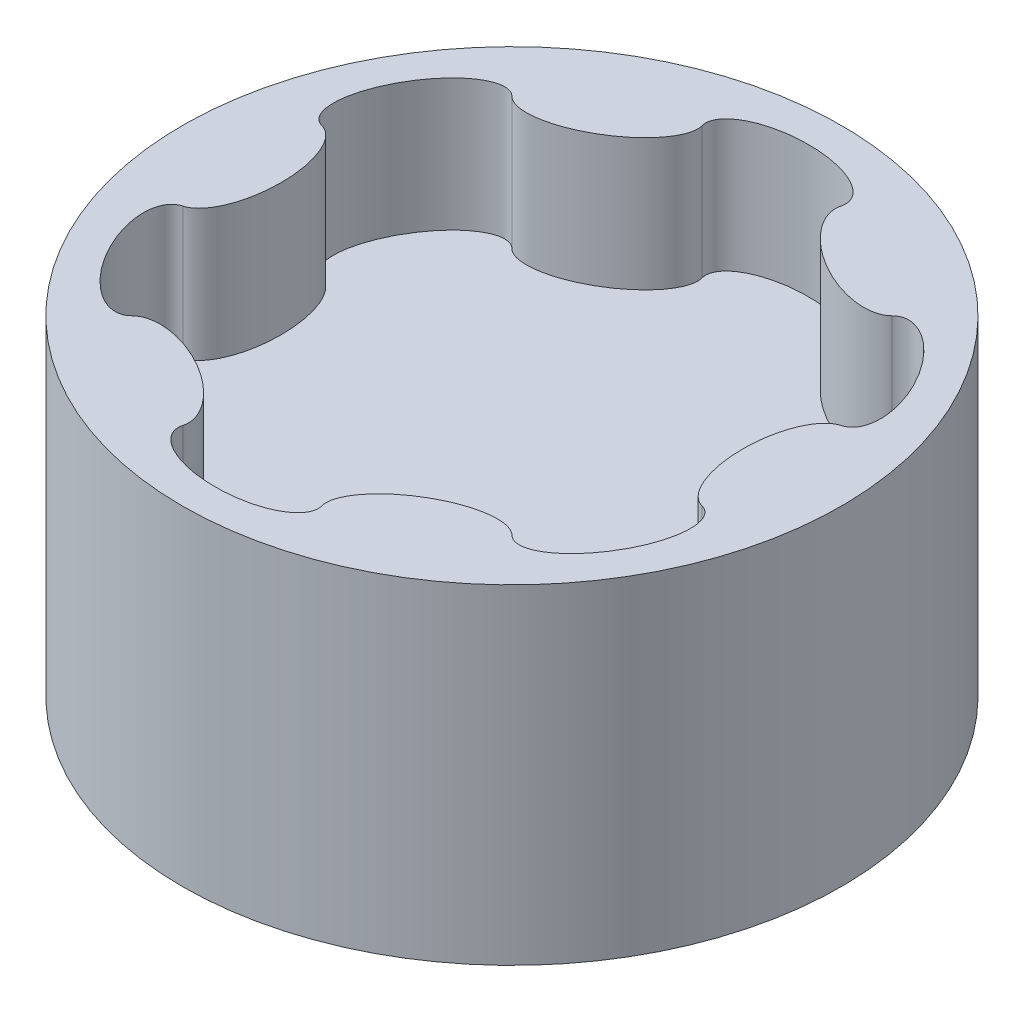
ISO-10303-21;
HEADER;
FILE_DESCRIPTION(('STEP AP214'),'2;1');
FILE_NAME('part.step','',(''),(''),'','','');
FILE_SCHEMA(('AUTOMOTIVE_DESIGN { 1 0 10303 214 1 1 1 1 }'));
ENDSEC;
DATA;
#1=APPLICATION_CONTEXT('core data for automotive mechanical design processes');
#2=APPLICATION_PROTOCOL_DEFINITION('international standard','automotive_design',2000,#1);
#3=PRODUCT_CONTEXT('',#1,'mechanical');
#4=PRODUCT('Part','Part','',(#3));
#5=PRODUCT_RELATED_PRODUCT_CATEGORY('part','',(#4));
#6=PRODUCT_DEFINITION_FORMATION('','',#4);
#7=PRODUCT_DEFINITION_CONTEXT('part definition',#1,'design');
#8=PRODUCT_DEFINITION('design','',#6,#7);
#9=PRODUCT_DEFINITION_SHAPE('','',#8);
#10=(LENGTH_UNIT() NAMED_UNIT(*) SI_UNIT(.MILLI.,.METRE.));
#11=(NAMED_UNIT(*) PLANE_ANGLE_UNIT() SI_UNIT($,.RADIAN.));
#12=(NAMED_UNIT(*) SI_UNIT($,.STERADIAN.) SOLID_ANGLE_UNIT());
#13=UNCERTAINTY_MEASURE_WITH_UNIT(LENGTH_MEASURE(1.E-05),#10,'distance_accuracy_value','');
#14=(GEOMETRIC_REPRESENTATION_CONTEXT(3) GLOBAL_UNCERTAINTY_ASSIGNED_CONTEXT((#13)) GLOBAL_UNIT_ASSIGNED_CONTEXT((#10,
#11,#12)) REPRESENTATION_CONTEXT('',''));
#15=CARTESIAN_POINT('',(0.,0.,0.));
#16=DIRECTION('',(0.,0.,1.));
#17=DIRECTION('',(1.,0.,0.));
#18=AXIS2_PLACEMENT_3D('',#15,#16,#17);
#19=CARTESIAN_POINT('',(0.,2.5,0.));
#20=DIRECTION('',(0.,1.,0.));
#21=DIRECTION('',(0.,0.,1.));
#22=AXIS2_PLACEMENT_3D('',#19,#20,#21);
#23=PLANE('',#22);
#24=CARTESIAN_POINT('',(0.,2.5,0.));
#25=DIRECTION('',(0.,1.,0.));
#26=DIRECTION('',(0.,0.,1.));
#27=AXIS2_PLACEMENT_3D('',#24,#25,#26);
#28=CIRCLE('',#27,5.);
#29=CARTESIAN_POINT('',(0.,2.5,5.));
#30=VERTEX_POINT('',#29);
#31=EDGE_CURVE('E11',#30,#30,#28,.T.);
#32=ORIENTED_EDGE('',*,*,#31,.T.);
#33=EDGE_LOOP('',(#32));
#34=FACE_BOUND('',#33,.T.);
#35=CARTESIAN_POINT('',(-3.46410161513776,2.5,-1.99999999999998));
#36=DIRECTION('',(0.,1.,0.));
#37=DIRECTION('',(0.499999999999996,0.,-0.866025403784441));
#38=AXIS2_PLACEMENT_3D('',#35,#36,#37);
#39=ELLIPSE('',#38,1.06339039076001,0.5);
#40=CARTESIAN_POINT('',(-2.88245005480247,2.5,-2.88245005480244));
#41=VERTEX_POINT('',#40);
#42=CARTESIAN_POINT('',(-3.93750000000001,2.5,-1.05504994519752));
#43=VERTEX_POINT('',#42);
#44=EDGE_CURVE('E1762',#41,#43,#39,.T.);
#45=ORIENTED_EDGE('',*,*,#44,.F.);
#46=CARTESIAN_POINT('',(-2.00000000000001,2.5,-3.46410161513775));
#47=DIRECTION('',(0.,1.,0.));
#48=DIRECTION('',(0.866025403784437,0.,-0.500000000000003));
#49=AXIS2_PLACEMENT_3D('',#46,#47,#48);
#50=ELLIPSE('',#49,1.06339039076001,0.5);
#51=CARTESIAN_POINT('',(-1.05504994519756,2.5,-3.9375));
#52=VERTEX_POINT('',#51);
#53=EDGE_CURVE('E1674',#41,#52,#50,.T.);
#54=ORIENTED_EDGE('',*,*,#53,.T.);
#55=CARTESIAN_POINT('',(0.,2.5,-4.));
#56=DIRECTION('',(0.,1.,0.));
#57=DIRECTION('',(-1.,0.,0.));
#58=AXIS2_PLACEMENT_3D('',#55,#56,#57);
#59=ELLIPSE('',#58,1.06339039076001,0.5);
#60=CARTESIAN_POINT('',(1.05504994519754,2.5,-3.9375));
#61=VERTEX_POINT('',#60);
#62=EDGE_CURVE('E1793',#61,#52,#59,.T.);
#63=ORIENTED_EDGE('',*,*,#62,.F.);
#64=CARTESIAN_POINT('',(1.99999999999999,2.5,-3.46410161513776));
#65=DIRECTION('',(0.,1.,0.));
#66=DIRECTION('',(0.86602540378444,0.,0.499999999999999));
#67=AXIS2_PLACEMENT_3D('',#64,#65,#66);
#68=ELLIPSE('',#67,1.06339039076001,0.499999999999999);
#69=CARTESIAN_POINT('',(2.88245005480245,2.5,-2.88245005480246));
#70=VERTEX_POINT('',#69);
#71=EDGE_CURVE('E1790',#61,#70,#68,.T.);
#72=ORIENTED_EDGE('',*,*,#71,.T.);
#73=CARTESIAN_POINT('',(3.46410161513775,2.5,-2.));
#74=DIRECTION('',(0.,1.,0.));
#75=DIRECTION('',(0.500000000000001,0.,0.866025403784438));
#76=AXIS2_PLACEMENT_3D('',#73,#74,#75);
#77=ELLIPSE('',#76,1.06339039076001,0.500000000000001);
#78=CARTESIAN_POINT('',(3.9375,2.5,-1.05504994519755));
#79=VERTEX_POINT('',#78);
#80=EDGE_CURVE('E1787',#79,#70,#77,.T.);
#81=ORIENTED_EDGE('',*,*,#80,.F.);
#82=CARTESIAN_POINT('',(4.,2.5,0.));
#83=DIRECTION('',(0.,1.,0.));
#84=DIRECTION('',(0.,0.,1.));
#85=AXIS2_PLACEMENT_3D('',#82,#83,#84);
#86=ELLIPSE('',#85,1.06339039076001,0.5);
#87=CARTESIAN_POINT('',(3.9375,2.5,1.05504994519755));
#88=VERTEX_POINT('',#87);
#89=EDGE_CURVE('E1784',#79,#88,#86,.T.);
#90=ORIENTED_EDGE('',*,*,#89,.T.);
#91=CARTESIAN_POINT('',(3.46410161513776,2.5,1.99999999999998));
#92=DIRECTION('',(0.,1.,0.));
#93=DIRECTION('',(0.499999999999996,0.,-0.866025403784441));
#94=AXIS2_PLACEMENT_3D('',#91,#92,#93);
#95=ELLIPSE('',#94,1.06339039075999,0.5);
#96=CARTESIAN_POINT('',(2.88245005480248,2.5,2.88245005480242));
#97=VERTEX_POINT('',#96);
#98=EDGE_CURVE('E1781',#97,#88,#95,.T.);
#99=ORIENTED_EDGE('',*,*,#98,.F.);
#100=CARTESIAN_POINT('',(2.00000000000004,2.5,3.46410161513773));
#101=DIRECTION('',(0.,1.,0.));
#102=DIRECTION('',(-0.866025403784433,0.,0.50000000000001));
#103=AXIS2_PLACEMENT_3D('',#100,#101,#102);
#104=ELLIPSE('',#103,1.06339039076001,0.500000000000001);
#105=CARTESIAN_POINT('',(1.05504994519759,2.5,3.93749999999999));
#106=VERTEX_POINT('',#105);
#107=EDGE_CURVE('E1778',#97,#106,#104,.T.);
#108=ORIENTED_EDGE('',*,*,#107,.T.);
#109=CARTESIAN_POINT('',(0.,2.5,4.));
#110=DIRECTION('',(0.,1.,0.));
#111=DIRECTION('',(-1.,0.,0.));
#112=AXIS2_PLACEMENT_3D('',#109,#110,#111);
#113=ELLIPSE('',#112,1.06339039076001,0.5);
#114=CARTESIAN_POINT('',(-1.05504994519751,2.5,3.93750000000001));
#115=VERTEX_POINT('',#114);
#116=EDGE_CURVE('E1775',#115,#106,#113,.T.);
#117=ORIENTED_EDGE('',*,*,#116,.F.);
#118=CARTESIAN_POINT('',(-1.99999999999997,2.5,3.46410161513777));
#119=DIRECTION('',(0.,1.,0.));
#120=DIRECTION('',(-0.866025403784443,0.,-0.499999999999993));
#121=AXIS2_PLACEMENT_3D('',#118,#119,#120);
#122=ELLIPSE('',#121,1.06339039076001,0.499999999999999);
#123=CARTESIAN_POINT('',(-2.88245005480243,2.5,2.88245005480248));
#124=VERTEX_POINT('',#123);
#125=EDGE_CURVE('E1770',#115,#124,#122,.T.);
#126=ORIENTED_EDGE('',*,*,#125,.T.);
#127=CARTESIAN_POINT('',(-3.46410161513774,2.5,2.00000000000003));
#128=DIRECTION('',(0.,1.,0.));
#129=DIRECTION('',(-0.500000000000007,0.,-0.866025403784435));
#130=AXIS2_PLACEMENT_3D('',#127,#128,#129);
#131=ELLIPSE('',#130,1.06339039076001,0.500000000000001);
#132=CARTESIAN_POINT('',(-3.93749999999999,2.5,1.05504994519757));
#133=VERTEX_POINT('',#132);
#134=EDGE_CURVE('E1768',#133,#124,#131,.T.);
#135=ORIENTED_EDGE('',*,*,#134,.F.);
#136=CARTESIAN_POINT('',(-4.,2.5,0.));
#137=DIRECTION('',(0.,1.,0.));
#138=DIRECTION('',(0.,0.,-1.));
#139=AXIS2_PLACEMENT_3D('',#136,#137,#138);
#140=ELLIPSE('',#139,1.06339039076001,0.5);
#141=EDGE_CURVE('E1751',#133,#43,#140,.T.);
#142=ORIENTED_EDGE('',*,*,#141,.T.);
#143=EDGE_LOOP('',(#45,#54,#63,#72,#81,#90,#99,#108,#117,#126,#135,#142));
#144=FACE_BOUND('',#143,.T.);
#145=ADVANCED_FACE('F1659',(#34,#144),#23,.T.);
#146=CARTESIAN_POINT('',(0.,2.5,0.));
#147=DIRECTION('',(0.,-1.,0.));
#148=DIRECTION('',(0.,0.,-1.));
#149=AXIS2_PLACEMENT_3D('',#146,#147,#148);
#150=CYLINDRICAL_SURFACE('',#149,5.);
#151=ORIENTED_EDGE('',*,*,#31,.F.);
#152=EDGE_LOOP('',(#151));
#153=FACE_BOUND('',#152,.T.);
#154=CARTESIAN_POINT('',(0.,-2.5,0.));
#155=DIRECTION('',(0.,1.,0.));
#156=DIRECTION('',(0.,0.,1.));
#157=AXIS2_PLACEMENT_3D('',#154,#155,#156);
#158=CIRCLE('',#157,5.);
#159=CARTESIAN_POINT('',(0.,-2.5,5.));
#160=VERTEX_POINT('',#159);
#161=EDGE_CURVE('E1667',#160,#160,#158,.T.);
#162=ORIENTED_EDGE('',*,*,#161,.T.);
#163=EDGE_LOOP('',(#162));
#164=FACE_BOUND('',#163,.T.);
#165=ADVANCED_FACE('F1661',(#153,#164),#150,.T.);
#166=CARTESIAN_POINT('',(0.,-2.5,0.));
#167=DIRECTION('',(0.,1.,0.));
#168=DIRECTION('',(0.,0.,1.));
#169=AXIS2_PLACEMENT_3D('',#166,#167,#168);
#170=PLANE('',#169);
#171=ORIENTED_EDGE('',*,*,#161,.F.);
#172=EDGE_LOOP('',(#171));
#173=FACE_BOUND('',#172,.T.);
#174=ADVANCED_FACE('F1807',(#173),#170,.F.);
#175=CARTESIAN_POINT('',(-2.00000000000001,0.5,-3.46410161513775));
#176=DIRECTION('',(0.,1.,0.));
#177=DIRECTION('',(0.866025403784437,0.,-0.500000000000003));
#178=AXIS2_PLACEMENT_3D('',#175,#176,#177);
#179=ELLIPSE('',#178,1.06339039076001,0.5);
#180=DIRECTION('',(0.,1.,0.));
#181=VECTOR('',#180,1.);
#182=SURFACE_OF_LINEAR_EXTRUSION('',#179,#181);
#183=ORIENTED_EDGE('',*,*,#53,.F.);
#184=DIRECTION('',(0.,1.,0.));
#185=VECTOR('',#184,1.);
#186=CARTESIAN_POINT('',(-2.88245005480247,0.5,-2.88245005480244));
#187=LINE('',#186,#185);
#188=CARTESIAN_POINT('',(-2.88245005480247,0.5,-2.88245005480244));
#189=VERTEX_POINT('',#188);
#190=EDGE_CURVE('E1759',#189,#41,#187,.T.);
#191=ORIENTED_EDGE('',*,*,#190,.F.);
#192=CARTESIAN_POINT('',(-1.05504994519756,0.5,-3.9375));
#193=VERTEX_POINT('',#192);
#194=EDGE_CURVE('E1679',#189,#193,#179,.T.);
#195=ORIENTED_EDGE('',*,*,#194,.T.);
#196=DIRECTION('',(0.,1.,0.));
#197=VECTOR('',#196,1.);
#198=CARTESIAN_POINT('',(-1.05504994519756,0.5,-3.9375));
#199=LINE('',#198,#197);
#200=EDGE_CURVE('E1821',#193,#52,#199,.T.);
#201=ORIENTED_EDGE('',*,*,#200,.T.);
#202=EDGE_LOOP('',(#183,#191,#195,#201));
#203=FACE_BOUND('',#202,.T.);
#204=ADVANCED_FACE('F1802',(#203),#182,.T.);
#205=CARTESIAN_POINT('',(0.,0.5,-4.));
#206=DIRECTION('',(0.,1.,0.));
#207=DIRECTION('',(-1.,0.,0.));
#208=AXIS2_PLACEMENT_3D('',#205,#206,#207);
#209=ELLIPSE('',#208,1.06339039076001,0.5);
#210=DIRECTION('',(0.,1.,0.));
#211=VECTOR('',#210,1.);
#212=SURFACE_OF_LINEAR_EXTRUSION('',#209,#211);
#213=ORIENTED_EDGE('',*,*,#62,.T.);
#214=ORIENTED_EDGE('',*,*,#200,.F.);
#215=CARTESIAN_POINT('',(1.05504994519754,0.5,-3.9375));
#216=VERTEX_POINT('',#215);
#217=EDGE_CURVE('E1825',#216,#193,#209,.T.);
#218=ORIENTED_EDGE('',*,*,#217,.F.);
#219=DIRECTION('',(0.,1.,0.));
#220=VECTOR('',#219,1.);
#221=CARTESIAN_POINT('',(1.05504994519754,0.5,-3.9375));
#222=LINE('',#221,#220);
#223=EDGE_CURVE('E1822',#216,#61,#222,.T.);
#224=ORIENTED_EDGE('',*,*,#223,.T.);
#225=EDGE_LOOP('',(#213,#214,#218,#224));
#226=FACE_BOUND('',#225,.T.);
#227=ADVANCED_FACE('F1806',(#226),#212,.F.);
#228=CARTESIAN_POINT('',(1.99999999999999,0.5,-3.46410161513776));
#229=DIRECTION('',(0.,1.,0.));
#230=DIRECTION('',(0.86602540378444,0.,0.499999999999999));
#231=AXIS2_PLACEMENT_3D('',#228,#229,#230);
#232=ELLIPSE('',#231,1.06339039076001,0.499999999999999);
#233=DIRECTION('',(0.,1.,0.));
#234=VECTOR('',#233,1.);
#235=SURFACE_OF_LINEAR_EXTRUSION('',#232,#234);
#236=ORIENTED_EDGE('',*,*,#71,.F.);
#237=ORIENTED_EDGE('',*,*,#223,.F.);
#238=CARTESIAN_POINT('',(2.88245005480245,0.5,-2.88245005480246));
#239=VERTEX_POINT('',#238);
#240=EDGE_CURVE('E1846',#216,#239,#232,.T.);
#241=ORIENTED_EDGE('',*,*,#240,.T.);
#242=DIRECTION('',(0.,1.,0.));
#243=VECTOR('',#242,1.);
#244=CARTESIAN_POINT('',(2.88245005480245,0.5,-2.88245005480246));
#245=LINE('',#244,#243);
#246=EDGE_CURVE('E1840',#239,#70,#245,.T.);
#247=ORIENTED_EDGE('',*,*,#246,.T.);
#248=EDGE_LOOP('',(#236,#237,#241,#247));
#249=FACE_BOUND('',#248,.T.);
#250=ADVANCED_FACE('F1853',(#249),#235,.T.);
#251=CARTESIAN_POINT('',(3.46410161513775,0.5,-2.));
#252=DIRECTION('',(0.,1.,0.));
#253=DIRECTION('',(0.500000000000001,0.,0.866025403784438));
#254=AXIS2_PLACEMENT_3D('',#251,#252,#253);
#255=ELLIPSE('',#254,1.06339039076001,0.500000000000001);
#256=DIRECTION('',(0.,1.,0.));
#257=VECTOR('',#256,1.);
#258=SURFACE_OF_LINEAR_EXTRUSION('',#255,#257);
#259=ORIENTED_EDGE('',*,*,#80,.T.);
#260=ORIENTED_EDGE('',*,*,#246,.F.);
#261=CARTESIAN_POINT('',(3.9375,0.5,-1.05504994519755));
#262=VERTEX_POINT('',#261);
#263=EDGE_CURVE('E1866',#262,#239,#255,.T.);
#264=ORIENTED_EDGE('',*,*,#263,.F.);
#265=DIRECTION('',(0.,1.,0.));
#266=VECTOR('',#265,1.);
#267=CARTESIAN_POINT('',(3.9375,0.5,-1.05504994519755));
#268=LINE('',#267,#266);
#269=EDGE_CURVE('E1838',#262,#79,#268,.T.);
#270=ORIENTED_EDGE('',*,*,#269,.T.);
#271=EDGE_LOOP('',(#259,#260,#264,#270));
#272=FACE_BOUND('',#271,.T.);
#273=ADVANCED_FACE('F1858',(#272),#258,.F.);
#274=CARTESIAN_POINT('',(4.,0.5,0.));
#275=DIRECTION('',(0.,1.,0.));
#276=DIRECTION('',(0.,0.,1.));
#277=AXIS2_PLACEMENT_3D('',#274,#275,#276);
#278=ELLIPSE('',#277,1.06339039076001,0.5);
#279=DIRECTION('',(0.,1.,0.));
#280=VECTOR('',#279,1.);
#281=SURFACE_OF_LINEAR_EXTRUSION('',#278,#280);
#282=ORIENTED_EDGE('',*,*,#89,.F.);
#283=ORIENTED_EDGE('',*,*,#269,.F.);
#284=CARTESIAN_POINT('',(3.9375,0.5,1.05504994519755));
#285=VERTEX_POINT('',#284);
#286=EDGE_CURVE('E1869',#262,#285,#278,.T.);
#287=ORIENTED_EDGE('',*,*,#286,.T.);
#288=DIRECTION('',(0.,1.,0.));
#289=VECTOR('',#288,1.);
#290=CARTESIAN_POINT('',(3.9375,0.5,1.05504994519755));
#291=LINE('',#290,#289);
#292=EDGE_CURVE('E1836',#285,#88,#291,.T.);
#293=ORIENTED_EDGE('',*,*,#292,.T.);
#294=EDGE_LOOP('',(#282,#283,#287,#293));
#295=FACE_BOUND('',#294,.T.);
#296=ADVANCED_FACE('F1862',(#295),#281,.T.);
#297=CARTESIAN_POINT('',(3.46410161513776,0.5,1.99999999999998));
#298=DIRECTION('',(0.,1.,0.));
#299=DIRECTION('',(0.499999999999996,0.,-0.866025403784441));
#300=AXIS2_PLACEMENT_3D('',#297,#298,#299);
#301=ELLIPSE('',#300,1.06339039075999,0.5);
#302=DIRECTION('',(0.,1.,0.));
#303=VECTOR('',#302,1.);
#304=SURFACE_OF_LINEAR_EXTRUSION('',#301,#303);
#305=ORIENTED_EDGE('',*,*,#98,.T.);
#306=ORIENTED_EDGE('',*,*,#292,.F.);
#307=CARTESIAN_POINT('',(2.88245005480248,0.5,2.88245005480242));
#308=VERTEX_POINT('',#307);
#309=EDGE_CURVE('E1872',#308,#285,#301,.T.);
#310=ORIENTED_EDGE('',*,*,#309,.F.);
#311=DIRECTION('',(0.,1.,0.));
#312=VECTOR('',#311,1.);
#313=CARTESIAN_POINT('',(2.88245005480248,0.5,2.88245005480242));
#314=LINE('',#313,#312);
#315=EDGE_CURVE('E1834',#308,#97,#314,.T.);
#316=ORIENTED_EDGE('',*,*,#315,.T.);
#317=EDGE_LOOP('',(#305,#306,#310,#316));
#318=FACE_BOUND('',#317,.T.);
#319=ADVANCED_FACE('F1879',(#318),#304,.F.);
#320=CARTESIAN_POINT('',(2.00000000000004,0.5,3.46410161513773));
#321=DIRECTION('',(0.,1.,0.));
#322=DIRECTION('',(-0.866025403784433,0.,0.50000000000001));
#323=AXIS2_PLACEMENT_3D('',#320,#321,#322);
#324=ELLIPSE('',#323,1.06339039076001,0.500000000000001);
#325=DIRECTION('',(0.,1.,0.));
#326=VECTOR('',#325,1.);
#327=SURFACE_OF_LINEAR_EXTRUSION('',#324,#326);
#328=ORIENTED_EDGE('',*,*,#107,.F.);
#329=ORIENTED_EDGE('',*,*,#315,.F.);
#330=CARTESIAN_POINT('',(1.05504994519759,0.5,3.93749999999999));
#331=VERTEX_POINT('',#330);
#332=EDGE_CURVE('E1876',#308,#331,#324,.T.);
#333=ORIENTED_EDGE('',*,*,#332,.T.);
#334=DIRECTION('',(0.,1.,0.));
#335=VECTOR('',#334,1.);
#336=CARTESIAN_POINT('',(1.05504994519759,0.5,3.93749999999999));
#337=LINE('',#336,#335);
#338=EDGE_CURVE('E1832',#331,#106,#337,.T.);
#339=ORIENTED_EDGE('',*,*,#338,.T.);
#340=EDGE_LOOP('',(#328,#329,#333,#339));
#341=FACE_BOUND('',#340,.T.);
#342=ADVANCED_FACE('F1882',(#341),#327,.T.);
#343=CARTESIAN_POINT('',(0.,0.5,4.));
#344=DIRECTION('',(0.,1.,0.));
#345=DIRECTION('',(-1.,0.,0.));
#346=AXIS2_PLACEMENT_3D('',#343,#344,#345);
#347=ELLIPSE('',#346,1.06339039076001,0.5);
#348=DIRECTION('',(0.,1.,0.));
#349=VECTOR('',#348,1.);
#350=SURFACE_OF_LINEAR_EXTRUSION('',#347,#349);
#351=ORIENTED_EDGE('',*,*,#116,.T.);
#352=ORIENTED_EDGE('',*,*,#338,.F.);
#353=CARTESIAN_POINT('',(-1.05504994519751,0.5,3.93750000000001));
#354=VERTEX_POINT('',#353);
#355=EDGE_CURVE('E1894',#354,#331,#347,.T.);
#356=ORIENTED_EDGE('',*,*,#355,.F.);
#357=DIRECTION('',(0.,1.,0.));
#358=VECTOR('',#357,1.);
#359=CARTESIAN_POINT('',(-1.05504994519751,0.5,3.93750000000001));
#360=LINE('',#359,#358);
#361=EDGE_CURVE('E1830',#354,#115,#360,.T.);
#362=ORIENTED_EDGE('',*,*,#361,.T.);
#363=EDGE_LOOP('',(#351,#352,#356,#362));
#364=FACE_BOUND('',#363,.T.);
#365=ADVANCED_FACE('F1886',(#364),#350,.F.);
#366=CARTESIAN_POINT('',(-1.99999999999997,0.5,3.46410161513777));
#367=DIRECTION('',(0.,1.,0.));
#368=DIRECTION('',(-0.866025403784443,0.,-0.499999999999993));
#369=AXIS2_PLACEMENT_3D('',#366,#367,#368);
#370=ELLIPSE('',#369,1.06339039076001,0.499999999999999);
#371=DIRECTION('',(0.,1.,0.));
#372=VECTOR('',#371,1.);
#373=SURFACE_OF_LINEAR_EXTRUSION('',#370,#372);
#374=ORIENTED_EDGE('',*,*,#125,.F.);
#375=ORIENTED_EDGE('',*,*,#361,.F.);
#376=CARTESIAN_POINT('',(-2.88245005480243,0.5,2.88245005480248));
#377=VERTEX_POINT('',#376);
#378=EDGE_CURVE('E1897',#354,#377,#370,.T.);
#379=ORIENTED_EDGE('',*,*,#378,.T.);
#380=DIRECTION('',(0.,1.,0.));
#381=VECTOR('',#380,1.);
#382=CARTESIAN_POINT('',(-2.88245005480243,0.5,2.88245005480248));
#383=LINE('',#382,#381);
#384=EDGE_CURVE('E1828',#377,#124,#383,.T.);
#385=ORIENTED_EDGE('',*,*,#384,.T.);
#386=EDGE_LOOP('',(#374,#375,#379,#385));
#387=FACE_BOUND('',#386,.T.);
#388=ADVANCED_FACE('F1890',(#387),#373,.T.);
#389=CARTESIAN_POINT('',(-3.46410161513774,0.5,2.00000000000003));
#390=DIRECTION('',(0.,1.,0.));
#391=DIRECTION('',(-0.500000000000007,0.,-0.866025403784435));
#392=AXIS2_PLACEMENT_3D('',#389,#390,#391);
#393=ELLIPSE('',#392,1.06339039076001,0.500000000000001);
#394=DIRECTION('',(0.,1.,0.));
#395=VECTOR('',#394,1.);
#396=SURFACE_OF_LINEAR_EXTRUSION('',#393,#395);
#397=ORIENTED_EDGE('',*,*,#134,.T.);
#398=ORIENTED_EDGE('',*,*,#384,.F.);
#399=CARTESIAN_POINT('',(-3.93749999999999,0.5,1.05504994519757));
#400=VERTEX_POINT('',#399);
#401=EDGE_CURVE('E1900',#400,#377,#393,.T.);
#402=ORIENTED_EDGE('',*,*,#401,.F.);
#403=DIRECTION('',(0.,1.,0.));
#404=VECTOR('',#403,1.);
#405=CARTESIAN_POINT('',(-3.93749999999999,0.5,1.05504994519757));
#406=LINE('',#405,#404);
#407=EDGE_CURVE('E1758',#400,#133,#406,.T.);
#408=ORIENTED_EDGE('',*,*,#407,.T.);
#409=EDGE_LOOP('',(#397,#398,#402,#408));
#410=FACE_BOUND('',#409,.T.);
#411=ADVANCED_FACE('F1904',(#410),#396,.F.);
#412=CARTESIAN_POINT('',(-4.,0.5,0.));
#413=DIRECTION('',(0.,1.,0.));
#414=DIRECTION('',(0.,0.,-1.));
#415=AXIS2_PLACEMENT_3D('',#412,#413,#414);
#416=ELLIPSE('',#415,1.06339039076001,0.5);
#417=DIRECTION('',(0.,1.,0.));
#418=VECTOR('',#417,1.);
#419=SURFACE_OF_LINEAR_EXTRUSION('',#416,#418);
#420=ORIENTED_EDGE('',*,*,#141,.F.);
#421=ORIENTED_EDGE('',*,*,#407,.F.);
#422=CARTESIAN_POINT('',(-3.93750000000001,0.5,-1.05504994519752));
#423=VERTEX_POINT('',#422);
#424=EDGE_CURVE('E1754',#400,#423,#416,.T.);
#425=ORIENTED_EDGE('',*,*,#424,.T.);
#426=DIRECTION('',(0.,1.,0.));
#427=VECTOR('',#426,1.);
#428=CARTESIAN_POINT('',(-3.93750000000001,0.5,-1.05504994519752));
#429=LINE('',#428,#427);
#430=EDGE_CURVE('E1747',#423,#43,#429,.T.);
#431=ORIENTED_EDGE('',*,*,#430,.T.);
#432=EDGE_LOOP('',(#420,#421,#425,#431));
#433=FACE_BOUND('',#432,.T.);
#434=ADVANCED_FACE('F1749',(#433),#419,.T.);
#435=CARTESIAN_POINT('',(-3.46410161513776,0.5,-1.99999999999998));
#436=DIRECTION('',(0.,1.,0.));
#437=DIRECTION('',(0.499999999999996,0.,-0.866025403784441));
#438=AXIS2_PLACEMENT_3D('',#435,#436,#437);
#439=ELLIPSE('',#438,1.06339039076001,0.5);
#440=DIRECTION('',(0.,1.,0.));
#441=VECTOR('',#440,1.);
#442=SURFACE_OF_LINEAR_EXTRUSION('',#439,#441);
#443=ORIENTED_EDGE('',*,*,#44,.T.);
#444=ORIENTED_EDGE('',*,*,#430,.F.);
#445=EDGE_CURVE('E1798',#189,#423,#439,.T.);
#446=ORIENTED_EDGE('',*,*,#445,.F.);
#447=ORIENTED_EDGE('',*,*,#190,.T.);
#448=EDGE_LOOP('',(#443,#444,#446,#447));
#449=FACE_BOUND('',#448,.T.);
#450=ADVANCED_FACE('F1763',(#449),#442,.F.);
#451=CARTESIAN_POINT('',(-11.1414213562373,0.5,0.));
#452=DIRECTION('',(0.,1.,0.));
#453=DIRECTION('',(0.,0.,1.));
#454=AXIS2_PLACEMENT_3D('',#451,#452,#453);
#455=PLANE('',#454);
#456=ORIENTED_EDGE('',*,*,#194,.F.);
#457=ORIENTED_EDGE('',*,*,#445,.T.);
#458=ORIENTED_EDGE('',*,*,#424,.F.);
#459=ORIENTED_EDGE('',*,*,#401,.T.);
#460=ORIENTED_EDGE('',*,*,#378,.F.);
#461=ORIENTED_EDGE('',*,*,#355,.T.);
#462=ORIENTED_EDGE('',*,*,#332,.F.);
#463=ORIENTED_EDGE('',*,*,#309,.T.);
#464=ORIENTED_EDGE('',*,*,#286,.F.);
#465=ORIENTED_EDGE('',*,*,#263,.T.);
#466=ORIENTED_EDGE('',*,*,#240,.F.);
#467=ORIENTED_EDGE('',*,*,#217,.T.);
#468=EDGE_LOOP('',(#456,#457,#458,#459,#460,#461,#462,#463,#464,#465,#466,#467));
#469=FACE_BOUND('',#468,.T.);
#470=ADVANCED_FACE('F1855',(#469),#455,.T.);
#471=CLOSED_SHELL('',(#145,#165,#174,#204,#227,#250,#273,#296,#319,#342,#365,#388,#411,#434,
#450,#470));
#472=MANIFOLD_SOLID_BREP('B2',#471);
#473=ADVANCED_BREP_SHAPE_REPRESENTATION('',(#18,#472),#14);
#474=SHAPE_DEFINITION_REPRESENTATION(#9,#473);
ENDSEC;
END-ISO-10303-21;
